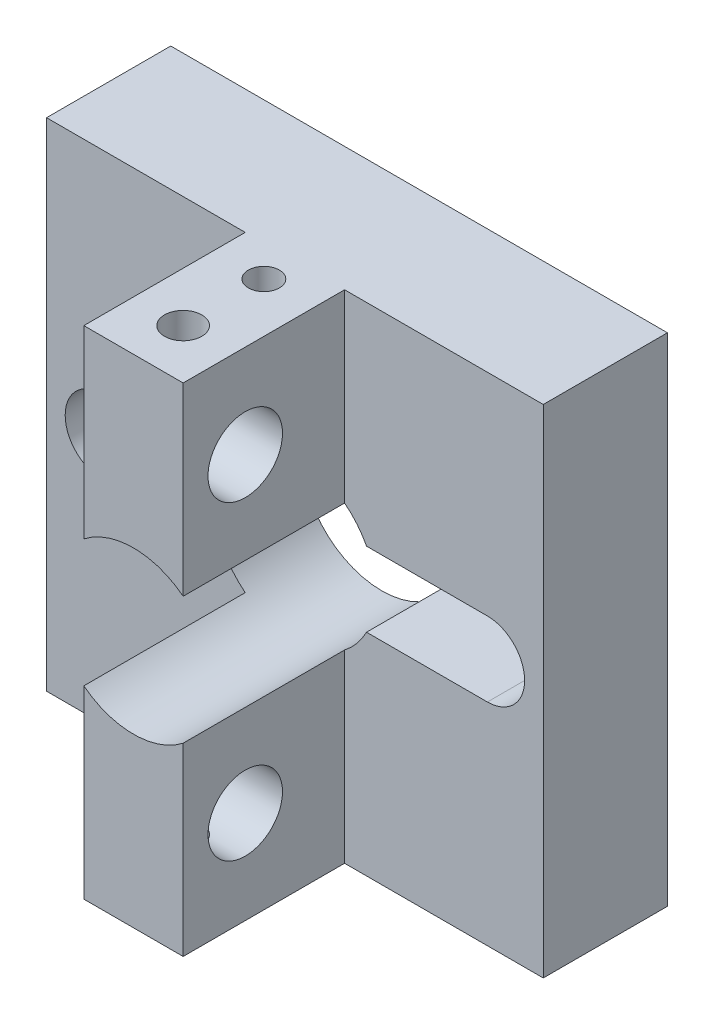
ISO-10303-21;
HEADER;
FILE_DESCRIPTION(('STEP AP214'),'2;1');
FILE_NAME('part.step','',(''),(''),'','','');
FILE_SCHEMA(('AUTOMOTIVE_DESIGN { 1 0 10303 214 1 1 1 1 }'));
ENDSEC;
DATA;
#1=APPLICATION_CONTEXT('core data for automotive mechanical design processes');
#2=APPLICATION_PROTOCOL_DEFINITION('international standard','automotive_design',2000,#1);
#3=PRODUCT_CONTEXT('',#1,'mechanical');
#4=PRODUCT('Part','Part','',(#3));
#5=PRODUCT_RELATED_PRODUCT_CATEGORY('part','',(#4));
#6=PRODUCT_DEFINITION_FORMATION('','',#4);
#7=PRODUCT_DEFINITION_CONTEXT('part definition',#1,'design');
#8=PRODUCT_DEFINITION('design','',#6,#7);
#9=PRODUCT_DEFINITION_SHAPE('','',#8);
#10=(LENGTH_UNIT() NAMED_UNIT(*) SI_UNIT(.MILLI.,.METRE.));
#11=(NAMED_UNIT(*) PLANE_ANGLE_UNIT() SI_UNIT($,.RADIAN.));
#12=(NAMED_UNIT(*) SI_UNIT($,.STERADIAN.) SOLID_ANGLE_UNIT());
#13=UNCERTAINTY_MEASURE_WITH_UNIT(LENGTH_MEASURE(1.E-05),#10,'distance_accuracy_value','');
#14=(GEOMETRIC_REPRESENTATION_CONTEXT(3) GLOBAL_UNCERTAINTY_ASSIGNED_CONTEXT((#13)) GLOBAL_UNIT_ASSIGNED_CONTEXT((#10,
#11,#12)) REPRESENTATION_CONTEXT('',''));
#15=CARTESIAN_POINT('',(0.,0.,0.));
#16=DIRECTION('',(0.,0.,1.));
#17=DIRECTION('',(1.,0.,0.));
#18=AXIS2_PLACEMENT_3D('',#15,#16,#17);
#19=CARTESIAN_POINT('',(0.,0.,10.));
#20=DIRECTION('',(0.,1.,0.));
#21=DIRECTION('',(0.,0.,1.));
#22=AXIS2_PLACEMENT_3D('',#19,#20,#21);
#23=PLANE('',#22);
#24=CARTESIAN_POINT('',(20.,0.,19.));
#25=DIRECTION('',(0.,-1.,0.));
#26=DIRECTION('',(0.,0.,-1.));
#27=AXIS2_PLACEMENT_3D('',#24,#25,#26);
#28=CIRCLE('',#27,1.50000000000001);
#29=CARTESIAN_POINT('',(20.,0.,17.5));
#30=VERTEX_POINT('',#29);
#31=EDGE_CURVE('E366',#30,#30,#28,.T.);
#32=ORIENTED_EDGE('',*,*,#31,.F.);
#33=EDGE_LOOP('',(#32));
#34=FACE_BOUND('',#33,.T.);
#35=DIRECTION('',(1.,0.,0.));
#36=VECTOR('',#35,1.);
#37=CARTESIAN_POINT('',(0.,0.,0.));
#38=LINE('',#37,#36);
#39=CARTESIAN_POINT('',(0.,0.,0.));
#40=VERTEX_POINT('',#39);
#41=CARTESIAN_POINT('',(40.,0.,0.));
#42=VERTEX_POINT('',#41);
#43=EDGE_CURVE('E250',#40,#42,#38,.T.);
#44=ORIENTED_EDGE('',*,*,#43,.T.);
#45=DIRECTION('',(0.,0.,-1.));
#46=VECTOR('',#45,1.);
#47=CARTESIAN_POINT('',(40.,0.,10.));
#48=LINE('',#47,#46);
#49=CARTESIAN_POINT('',(40.,0.,10.));
#50=VERTEX_POINT('',#49);
#51=EDGE_CURVE('E245',#50,#42,#48,.T.);
#52=ORIENTED_EDGE('',*,*,#51,.F.);
#53=DIRECTION('',(1.,0.,0.));
#54=VECTOR('',#53,1.);
#55=CARTESIAN_POINT('',(0.,0.,10.));
#56=LINE('',#55,#54);
#57=CARTESIAN_POINT('',(24.,0.,9.99999999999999));
#58=VERTEX_POINT('',#57);
#59=EDGE_CURVE('E274',#58,#50,#56,.T.);
#60=ORIENTED_EDGE('',*,*,#59,.F.);
#61=DIRECTION('',(0.,0.,-1.));
#62=VECTOR('',#61,1.);
#63=CARTESIAN_POINT('',(24.,0.,23.));
#64=LINE('',#63,#62);
#65=CARTESIAN_POINT('',(24.,0.,23.));
#66=VERTEX_POINT('',#65);
#67=EDGE_CURVE('E306',#66,#58,#64,.T.);
#68=ORIENTED_EDGE('',*,*,#67,.F.);
#69=DIRECTION('',(1.,0.,0.));
#70=VECTOR('',#69,1.);
#71=CARTESIAN_POINT('',(16.,0.,23.));
#72=LINE('',#71,#70);
#73=CARTESIAN_POINT('',(16.,0.,23.));
#74=VERTEX_POINT('',#73);
#75=EDGE_CURVE('E302',#74,#66,#72,.T.);
#76=ORIENTED_EDGE('',*,*,#75,.F.);
#77=DIRECTION('',(0.,0.,-1.));
#78=VECTOR('',#77,1.);
#79=CARTESIAN_POINT('',(16.,0.,23.));
#80=LINE('',#79,#78);
#81=CARTESIAN_POINT('',(16.,0.,9.99999999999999));
#82=VERTEX_POINT('',#81);
#83=EDGE_CURVE('E299',#74,#82,#80,.T.);
#84=ORIENTED_EDGE('',*,*,#83,.T.);
#85=CARTESIAN_POINT('',(0.,0.,10.));
#86=VERTEX_POINT('',#85);
#87=EDGE_CURVE('E276',#86,#82,#56,.T.);
#88=ORIENTED_EDGE('',*,*,#87,.F.);
#89=DIRECTION('',(0.,0.,-1.));
#90=VECTOR('',#89,1.);
#91=CARTESIAN_POINT('',(0.,0.,10.));
#92=LINE('',#91,#90);
#93=EDGE_CURVE('E280',#86,#40,#92,.T.);
#94=ORIENTED_EDGE('',*,*,#93,.T.);
#95=EDGE_LOOP('',(#44,#52,#60,#68,#76,#84,#88,#94));
#96=FACE_BOUND('',#95,.T.);
#97=CARTESIAN_POINT('',(20.,0.,12.5));
#98=DIRECTION('',(0.,-1.,0.));
#99=DIRECTION('',(0.,0.,-1.));
#100=AXIS2_PLACEMENT_3D('',#97,#98,#99);
#101=CIRCLE('',#100,1.25);
#102=CARTESIAN_POINT('',(20.,0.,11.25));
#103=VERTEX_POINT('',#102);
#104=EDGE_CURVE('E817',#103,#103,#101,.T.);
#105=ORIENTED_EDGE('',*,*,#104,.F.);
#106=EDGE_LOOP('',(#105));
#107=FACE_BOUND('',#106,.T.);
#108=ADVANCED_FACE('F37',(#34,#96,#107),#23,.F.);
#109=CARTESIAN_POINT('',(40.,40.,10.));
#110=DIRECTION('',(0.,-1.,0.));
#111=DIRECTION('',(0.,0.,-1.));
#112=AXIS2_PLACEMENT_3D('',#109,#110,#111);
#113=PLANE('',#112);
#114=CARTESIAN_POINT('',(20.,40.,19.));
#115=DIRECTION('',(0.,1.,0.));
#116=DIRECTION('',(0.,0.,1.));
#117=AXIS2_PLACEMENT_3D('',#114,#115,#116);
#118=CIRCLE('',#117,1.50000000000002);
#119=CARTESIAN_POINT('',(20.,40.,20.5));
#120=VERTEX_POINT('',#119);
#121=EDGE_CURVE('E336',#120,#120,#118,.T.);
#122=ORIENTED_EDGE('',*,*,#121,.F.);
#123=EDGE_LOOP('',(#122));
#124=FACE_BOUND('',#123,.T.);
#125=DIRECTION('',(-1.,0.,0.));
#126=VECTOR('',#125,1.);
#127=CARTESIAN_POINT('',(40.,40.,0.));
#128=LINE('',#127,#126);
#129=CARTESIAN_POINT('',(40.,40.,0.));
#130=VERTEX_POINT('',#129);
#131=CARTESIAN_POINT('',(0.,40.,0.));
#132=VERTEX_POINT('',#131);
#133=EDGE_CURVE('E251',#130,#132,#128,.T.);
#134=ORIENTED_EDGE('',*,*,#133,.T.);
#135=DIRECTION('',(0.,0.,-1.));
#136=VECTOR('',#135,1.);
#137=CARTESIAN_POINT('',(0.,40.,10.));
#138=LINE('',#137,#136);
#139=CARTESIAN_POINT('',(0.,40.,10.));
#140=VERTEX_POINT('',#139);
#141=EDGE_CURVE('E285',#140,#132,#138,.T.);
#142=ORIENTED_EDGE('',*,*,#141,.F.);
#143=DIRECTION('',(-1.,0.,0.));
#144=VECTOR('',#143,1.);
#145=CARTESIAN_POINT('',(40.,40.,10.));
#146=LINE('',#145,#144);
#147=CARTESIAN_POINT('',(16.,40.,10.));
#148=VERTEX_POINT('',#147);
#149=EDGE_CURVE('E262',#148,#140,#146,.T.);
#150=ORIENTED_EDGE('',*,*,#149,.F.);
#151=DIRECTION('',(0.,0.,-1.));
#152=VECTOR('',#151,1.);
#153=CARTESIAN_POINT('',(16.,40.,23.));
#154=LINE('',#153,#152);
#155=CARTESIAN_POINT('',(16.,40.,23.));
#156=VERTEX_POINT('',#155);
#157=EDGE_CURVE('E534',#156,#148,#154,.T.);
#158=ORIENTED_EDGE('',*,*,#157,.F.);
#159=DIRECTION('',(-1.,0.,0.));
#160=VECTOR('',#159,1.);
#161=CARTESIAN_POINT('',(24.,40.,23.));
#162=LINE('',#161,#160);
#163=CARTESIAN_POINT('',(24.,40.,23.));
#164=VERTEX_POINT('',#163);
#165=EDGE_CURVE('E530',#164,#156,#162,.T.);
#166=ORIENTED_EDGE('',*,*,#165,.F.);
#167=DIRECTION('',(0.,0.,-1.));
#168=VECTOR('',#167,1.);
#169=CARTESIAN_POINT('',(24.,40.,23.));
#170=LINE('',#169,#168);
#171=CARTESIAN_POINT('',(24.,40.,10.));
#172=VERTEX_POINT('',#171);
#173=EDGE_CURVE('E520',#164,#172,#170,.T.);
#174=ORIENTED_EDGE('',*,*,#173,.T.);
#175=CARTESIAN_POINT('',(40.,40.,10.));
#176=VERTEX_POINT('',#175);
#177=EDGE_CURVE('E271',#176,#172,#146,.T.);
#178=ORIENTED_EDGE('',*,*,#177,.F.);
#179=DIRECTION('',(0.,0.,-1.));
#180=VECTOR('',#179,1.);
#181=CARTESIAN_POINT('',(40.,40.,10.));
#182=LINE('',#181,#180);
#183=EDGE_CURVE('E242',#176,#130,#182,.T.);
#184=ORIENTED_EDGE('',*,*,#183,.T.);
#185=EDGE_LOOP('',(#134,#142,#150,#158,#166,#174,#178,#184));
#186=FACE_BOUND('',#185,.T.);
#187=CARTESIAN_POINT('',(20.,40.,12.5));
#188=DIRECTION('',(0.,1.,0.));
#189=DIRECTION('',(0.,0.,1.));
#190=AXIS2_PLACEMENT_3D('',#187,#188,#189);
#191=CIRCLE('',#190,1.25);
#192=CARTESIAN_POINT('',(20.,40.,13.75));
#193=VERTEX_POINT('',#192);
#194=EDGE_CURVE('E374',#193,#193,#191,.T.);
#195=ORIENTED_EDGE('',*,*,#194,.F.);
#196=EDGE_LOOP('',(#195));
#197=FACE_BOUND('',#196,.T.);
#198=ADVANCED_FACE('F212',(#124,#186,#197),#113,.F.);
#199=CARTESIAN_POINT('',(-2.50000000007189E-05,7.5,18.));
#200=DIRECTION('',(1.,0.,0.));
#201=DIRECTION('',(0.,0.,-1.));
#202=AXIS2_PLACEMENT_3D('',#199,#200,#201);
#203=CYLINDRICAL_SURFACE('',#202,3.);
#204=CARTESIAN_POINT('',(24.,7.5,18.));
#205=DIRECTION('',(1.,0.,0.));
#206=DIRECTION('',(0.,0.,-1.));
#207=AXIS2_PLACEMENT_3D('',#204,#205,#206);
#208=CIRCLE('',#207,3.);
#209=CARTESIAN_POINT('',(24.,7.5,15.));
#210=VERTEX_POINT('',#209);
#211=EDGE_CURVE('E335',#210,#210,#208,.T.);
#212=ORIENTED_EDGE('',*,*,#211,.T.);
#213=EDGE_LOOP('',(#212));
#214=FACE_BOUND('',#213,.T.);
#215=CARTESIAN_POINT('',(16.,7.5,18.));
#216=DIRECTION('',(-1.,0.,0.));
#217=DIRECTION('',(0.,0.,1.));
#218=AXIS2_PLACEMENT_3D('',#215,#216,#217);
#219=CIRCLE('',#218,3.);
#220=CARTESIAN_POINT('',(16.,7.5,21.));
#221=VERTEX_POINT('',#220);
#222=EDGE_CURVE('E362',#221,#221,#219,.T.);
#223=ORIENTED_EDGE('',*,*,#222,.T.);
#224=EDGE_LOOP('',(#223));
#225=FACE_BOUND('',#224,.T.);
#226=CARTESIAN_POINT('',(20.,4.54196010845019,17.5));
#227=CARTESIAN_POINT('',(19.9161367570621,4.5419561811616,17.5000040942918));
#228=CARTESIAN_POINT('',(19.8321706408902,4.54073940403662,17.507062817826));
#229=CARTESIAN_POINT('',(19.6665464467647,4.53620601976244,17.5351144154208));
#230=CARTESIAN_POINT('',(19.5848933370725,4.53288520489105,17.5561352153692));
#231=CARTESIAN_POINT('',(19.4263961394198,4.52513520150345,17.6114715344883));
#232=CARTESIAN_POINT('',(19.3495457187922,4.52070751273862,17.6457690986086));
#233=CARTESIAN_POINT('',(19.2026537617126,4.51219807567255,17.7267085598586));
#234=CARTESIAN_POINT('',(19.132610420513,4.50811623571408,17.7733471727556));
#235=CARTESIAN_POINT('',(19.0007747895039,4.5020170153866,17.8780895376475));
#236=CARTESIAN_POINT('',(18.9390425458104,4.50001402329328,17.9362699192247));
#237=CARTESIAN_POINT('',(18.8262553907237,4.49998616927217,18.0622039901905));
#238=CARTESIAN_POINT('',(18.775197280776,4.50196011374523,18.129954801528));
#239=CARTESIAN_POINT('',(18.6869436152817,4.51140252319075,18.2702701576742));
#240=CARTESIAN_POINT('',(18.6493201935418,4.51867339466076,18.3425783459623));
#241=CARTESIAN_POINT('',(18.5865019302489,4.5395864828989,18.4915225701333));
#242=CARTESIAN_POINT('',(18.5613018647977,4.55322601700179,18.5681567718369));
#243=CARTESIAN_POINT('',(18.5245914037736,4.58648601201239,18.7191039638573));
#244=CARTESIAN_POINT('',(18.5124583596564,4.60577256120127,18.7933408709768));
#245=CARTESIAN_POINT('',(18.4993294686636,4.65034824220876,18.9409750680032));
#246=CARTESIAN_POINT('',(18.498335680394,4.67563848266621,19.0143722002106));
#247=CARTESIAN_POINT('',(18.5067850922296,4.73254659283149,19.1608548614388));
#248=CARTESIAN_POINT('',(18.5165793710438,4.76434819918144,19.233847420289));
#249=CARTESIAN_POINT('',(18.5459471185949,4.83273211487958,19.3754549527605));
#250=CARTESIAN_POINT('',(18.56552354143,4.86931586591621,19.4440685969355));
#251=CARTESIAN_POINT('',(18.6166757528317,4.95172987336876,19.5855441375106));
#252=CARTESIAN_POINT('',(18.6495754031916,4.99813263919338,19.6575903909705));
#253=CARTESIAN_POINT('',(18.7250607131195,5.09414976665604,19.7941204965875));
#254=CARTESIAN_POINT('',(18.7676580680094,5.14376795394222,19.8585950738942));
#255=CARTESIAN_POINT('',(18.8709881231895,5.25469929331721,19.9918786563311));
#256=CARTESIAN_POINT('',(18.9336465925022,5.31634487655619,20.0589185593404));
#257=CARTESIAN_POINT('',(19.0707617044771,5.43837845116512,20.1810845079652));
#258=CARTESIAN_POINT('',(19.1452131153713,5.49876698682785,20.2362158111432));
#259=CARTESIAN_POINT('',(19.2778401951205,5.59265229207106,20.3161120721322));
#260=CARTESIAN_POINT('',(19.3323655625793,5.62806527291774,20.3446981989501));
#261=CARTESIAN_POINT('',(19.4470364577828,5.69389106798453,20.3957653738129));
#262=CARTESIAN_POINT('',(19.5071722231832,5.72431232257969,20.4182567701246));
#263=CARTESIAN_POINT('',(19.6177338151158,5.77036685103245,20.4513205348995));
#264=CARTESIAN_POINT('',(19.6669239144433,5.78779711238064,20.463463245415));
#265=CARTESIAN_POINT('',(19.7680840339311,5.8160362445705,20.482853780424));
#266=CARTESIAN_POINT('',(19.8200487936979,5.82685719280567,20.4901105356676));
#267=CARTESIAN_POINT('',(19.9260380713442,5.84034662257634,20.4991248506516));
#268=CARTESIAN_POINT('',(19.9800769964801,5.84294027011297,20.5008319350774));
#269=CARTESIAN_POINT('',(20.0877244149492,5.83928003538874,20.4984017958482));
#270=CARTESIAN_POINT('',(20.141332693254,5.83302197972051,20.4942618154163));
#271=CARTESIAN_POINT('',(20.2511709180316,5.81180807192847,20.4799551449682));
#272=CARTESIAN_POINT('',(20.3071795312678,5.79609592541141,20.4692627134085));
#273=CARTESIAN_POINT('',(20.4154276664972,5.75782374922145,20.4424101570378));
#274=CARTESIAN_POINT('',(20.467657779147,5.7352473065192,20.4262369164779));
#275=CARTESIAN_POINT('',(20.5963654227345,5.67156743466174,20.378895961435));
#276=CARTESIAN_POINT('',(20.6699702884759,5.62718309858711,20.3444098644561));
#277=CARTESIAN_POINT('',(20.8082833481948,5.53313057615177,20.2661008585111));
#278=CARTESIAN_POINT('',(20.8729678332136,5.48344890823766,20.2222538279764));
#279=CARTESIAN_POINT('',(21.0122625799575,5.36698103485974,20.1115093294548));
#280=CARTESIAN_POINT('',(21.0839956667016,5.29954949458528,20.0416467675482));
#281=CARTESIAN_POINT('',(21.2128927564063,5.16654332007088,19.8881987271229));
#282=CARTESIAN_POINT('',(21.2700720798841,5.1009667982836,19.804627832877));
#283=CARTESIAN_POINT('',(21.3582410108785,4.98761057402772,19.6418739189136));
#284=CARTESIAN_POINT('',(21.3921573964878,4.93884250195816,19.5649708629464));
#285=CARTESIAN_POINT('',(21.4471929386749,4.846974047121,19.4035794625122));
#286=CARTESIAN_POINT('',(21.4683299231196,4.80386583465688,19.3191018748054));
#287=CARTESIAN_POINT('',(21.4936040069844,4.73108312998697,19.1574724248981));
#288=CARTESIAN_POINT('',(21.4998134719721,4.7003636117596,19.0811190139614));
#289=CARTESIAN_POINT('',(21.5001778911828,4.64533270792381,18.9260805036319));
#290=CARTESIAN_POINT('',(21.4943381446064,4.62101851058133,18.8473964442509));
#291=CARTESIAN_POINT('',(21.46976090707,4.57925789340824,18.6898759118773));
#292=CARTESIAN_POINT('',(21.4509766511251,4.56183673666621,18.6110399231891));
#293=CARTESIAN_POINT('',(21.4003887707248,4.53387450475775,18.4563748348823));
#294=CARTESIAN_POINT('',(21.3685855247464,4.52333322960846,18.380545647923));
#295=CARTESIAN_POINT('',(21.2950982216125,4.50876881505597,18.2393040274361));
#296=CARTESIAN_POINT('',(21.2541648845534,4.50437612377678,18.1735361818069));
#297=CARTESIAN_POINT('',(21.1625813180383,4.49975257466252,18.0490112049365));
#298=CARTESIAN_POINT('',(21.1119306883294,4.49952188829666,17.9902543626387));
#299=CARTESIAN_POINT('',(21.0005421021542,4.50188921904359,17.8796131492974));
#300=CARTESIAN_POINT('',(20.9395428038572,4.50457404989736,17.8279942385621));
#301=CARTESIAN_POINT('',(20.8101507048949,4.51135525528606,17.7350870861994));
#302=CARTESIAN_POINT('',(20.7417529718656,4.51545257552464,17.6938057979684));
#303=CARTESIAN_POINT('',(20.5955485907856,4.52382915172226,17.6207441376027));
#304=CARTESIAN_POINT('',(20.5174369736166,4.52810671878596,17.589573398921));
#305=CARTESIAN_POINT('',(20.3571477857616,4.53525744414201,17.5407399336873));
#306=CARTESIAN_POINT('',(20.2749784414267,4.53813332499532,17.5230509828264));
#307=CARTESIAN_POINT('',(20.1601586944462,4.54057921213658,17.508228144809));
#308=CARTESIAN_POINT('',(20.1282112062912,4.54109424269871,17.5051451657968));
#309=CARTESIAN_POINT('',(20.0641808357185,4.5417854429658,17.5010303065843));
#310=CARTESIAN_POINT('',(20.032097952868,4.54196161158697,17.4999984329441));
#311=CARTESIAN_POINT('',(20.,4.54196010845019,17.5));
#312=B_SPLINE_CURVE_WITH_KNOTS('',3,(#226,#227,#228,#229,#230,#231,#232,#233,#234,#235,#236,
#237,#238,#239,#240,#241,#242,#243,#244,#245,#246,#247,#248,#249,#250,#251,#252,#253,#254,#255,
#256,#257,#258,#259,#260,#261,#262,#263,#264,#265,#266,#267,#268,#269,#270,#271,#272,#273,#274,
#275,#276,#277,#278,#279,#280,#281,#282,#283,#284,#285,#286,#287,#288,#289,#290,#291,#292,#293,
#294,#295,#296,#297,#298,#299,#300,#301,#302,#303,#304,#305,#306,#307,#308,#309,#310,#311),
.UNSPECIFIED.,.T.,.F.,(4,2,2,2,2,2,2,2,2,2,2,2,2,2,2,2,2,2,2,2,2,2,2,2,2,2,2,2,2,2,2,2,2,2,2,2,
2,2,2,2,2,2,4),(0.,0.25146735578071,0.503439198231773,0.755071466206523,1.00663683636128,
1.25993197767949,1.51315110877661,1.75737869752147,2.00150350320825,2.23339659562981,
2.46533254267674,2.70504550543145,2.94483090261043,3.21921669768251,3.49393516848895,
3.82432149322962,4.15456165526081,4.36715732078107,4.579389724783,4.73957138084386,
4.89945944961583,5.06079772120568,5.22221208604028,5.39867067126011,5.5755545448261,
5.8518633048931,6.12889285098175,6.48934985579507,6.84942582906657,7.13982793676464,
7.42982397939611,7.67637596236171,7.92281953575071,8.17015814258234,8.41748955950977,
8.64920345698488,8.88092690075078,9.11974429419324,9.35872189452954,9.61019489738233,
9.86117748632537,9.9574241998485,10.0536712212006),.UNSPECIFIED.);
#313=CARTESIAN_POINT('',(20.,4.54196010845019,17.5));
#314=VERTEX_POINT('',#313);
#315=EDGE_CURVE('E41',#314,#314,#312,.T.);
#316=ORIENTED_EDGE('',*,*,#315,.F.);
#317=EDGE_LOOP('',(#316));
#318=FACE_BOUND('',#317,.T.);
#319=ADVANCED_FACE('F218',(#214,#225,#318),#203,.F.);
#320=CARTESIAN_POINT('',(-2.50000000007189E-05,32.5,18.));
#321=DIRECTION('',(1.,0.,0.));
#322=DIRECTION('',(0.,0.,-1.));
#323=AXIS2_PLACEMENT_3D('',#320,#321,#322);
#324=CYLINDRICAL_SURFACE('',#323,3.);
#325=CARTESIAN_POINT('',(24.,32.5,18.));
#326=DIRECTION('',(1.,0.,0.));
#327=DIRECTION('',(0.,0.,-1.));
#328=AXIS2_PLACEMENT_3D('',#325,#326,#327);
#329=CIRCLE('',#328,3.);
#330=CARTESIAN_POINT('',(24.,32.5,15.));
#331=VERTEX_POINT('',#330);
#332=EDGE_CURVE('E380',#331,#331,#329,.T.);
#333=ORIENTED_EDGE('',*,*,#332,.T.);
#334=EDGE_LOOP('',(#333));
#335=FACE_BOUND('',#334,.T.);
#336=CARTESIAN_POINT('',(16.,32.5,18.));
#337=DIRECTION('',(-1.,0.,0.));
#338=DIRECTION('',(0.,0.,1.));
#339=AXIS2_PLACEMENT_3D('',#336,#337,#338);
#340=CIRCLE('',#339,3.);
#341=CARTESIAN_POINT('',(16.,32.5,21.));
#342=VERTEX_POINT('',#341);
#343=EDGE_CURVE('E383',#342,#342,#340,.T.);
#344=ORIENTED_EDGE('',*,*,#343,.T.);
#345=EDGE_LOOP('',(#344));
#346=FACE_BOUND('',#345,.T.);
#347=CARTESIAN_POINT('',(20.,34.1583123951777,20.5));
#348=CARTESIAN_POINT('',(19.948548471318,34.1583206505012,20.4999961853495));
#349=CARTESIAN_POINT('',(19.8970200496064,34.1623716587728,20.4973216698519));
#350=CARTESIAN_POINT('',(19.7955955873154,34.1779339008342,20.4868892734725));
#351=CARTESIAN_POINT('',(19.7457044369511,34.1894656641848,20.4791174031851));
#352=CARTESIAN_POINT('',(19.6330347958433,34.2231131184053,20.4558935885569));
#353=CARTESIAN_POINT('',(19.5712747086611,34.2474403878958,20.4387751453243));
#354=CARTESIAN_POINT('',(19.4531015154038,34.3027893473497,20.3981524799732));
#355=CARTESIAN_POINT('',(19.3967032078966,34.3338288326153,20.3746312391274));
#356=CARTESIAN_POINT('',(19.2578319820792,34.4189379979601,20.3069613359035));
#357=CARTESIAN_POINT('',(19.1791519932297,34.4759420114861,20.2587518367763));
#358=CARTESIAN_POINT('',(19.0332784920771,34.5932488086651,20.1505209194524));
#359=CARTESIAN_POINT('',(18.9661021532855,34.6535563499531,20.090482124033));
#360=CARTESIAN_POINT('',(18.8407723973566,34.7760932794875,19.9565188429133));
#361=CARTESIAN_POINT('',(18.7830871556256,34.8383030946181,19.882135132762));
#362=CARTESIAN_POINT('',(18.6816316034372,34.9588036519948,19.7217193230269));
#363=CARTESIAN_POINT('',(18.6378376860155,35.0171009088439,19.6357073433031));
#364=CARTESIAN_POINT('',(18.5736954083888,35.1160009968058,19.471010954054));
#365=CARTESIAN_POINT('',(18.5504316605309,35.1578303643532,19.3942048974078));
#366=CARTESIAN_POINT('',(18.5162814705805,35.2354596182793,19.234943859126));
#367=CARTESIAN_POINT('',(18.5053886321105,35.2712626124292,19.1524918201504));
#368=CARTESIAN_POINT('',(18.4976917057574,35.3356856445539,18.9834228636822));
#369=CARTESIAN_POINT('',(18.5009906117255,35.3642515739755,18.8967800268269));
#370=CARTESIAN_POINT('',(18.5231871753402,35.4129406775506,18.7231118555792));
#371=CARTESIAN_POINT('',(18.5420741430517,35.4330696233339,18.6360868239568));
#372=CARTESIAN_POINT('',(18.5923588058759,35.4630038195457,18.4758587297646));
#373=CARTESIAN_POINT('',(18.621954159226,35.4737673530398,18.4022624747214));
#374=CARTESIAN_POINT('',(18.692714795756,35.4895487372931,18.2602035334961));
#375=CARTESIAN_POINT('',(18.7338793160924,35.4945669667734,18.191740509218));
#376=CARTESIAN_POINT('',(18.8254474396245,35.4999887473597,18.063805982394));
#377=CARTESIAN_POINT('',(18.875585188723,35.5005080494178,18.0041480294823));
#378=CARTESIAN_POINT('',(18.9844577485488,35.4986160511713,17.8933335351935));
#379=CARTESIAN_POINT('',(19.0431943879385,35.4962041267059,17.8421788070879));
#380=CARTESIAN_POINT('',(19.1711560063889,35.4897237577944,17.7471215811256));
#381=CARTESIAN_POINT('',(19.2407738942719,35.4855736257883,17.7037531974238));
#382=CARTESIAN_POINT('',(19.3861401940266,35.4772004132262,17.6289194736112));
#383=CARTESIAN_POINT('',(19.4618896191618,35.4729773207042,17.5974561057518));
#384=CARTESIAN_POINT('',(19.6200723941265,35.4656354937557,17.5464603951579));
#385=CARTESIAN_POINT('',(19.7026423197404,35.4625566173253,17.5273440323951));
#386=CARTESIAN_POINT('',(19.8698678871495,35.4586164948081,17.5032700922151));
#387=CARTESIAN_POINT('',(19.9545233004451,35.4577550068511,17.4983109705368));
#388=CARTESIAN_POINT('',(20.1224904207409,35.4584917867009,17.5026775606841));
#389=CARTESIAN_POINT('',(20.2058064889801,35.4600623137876,17.5118421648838));
#390=CARTESIAN_POINT('',(20.3697006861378,35.4651662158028,17.543876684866));
#391=CARTESIAN_POINT('',(20.4502785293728,35.4686997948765,17.5667480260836));
#392=CARTESIAN_POINT('',(20.6065842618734,35.4766900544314,17.625576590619));
#393=CARTESIAN_POINT('',(20.6823050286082,35.4811480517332,17.6615525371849));
#394=CARTESIAN_POINT('',(20.826746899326,35.4894929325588,17.7456184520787));
#395=CARTESIAN_POINT('',(20.8954670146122,35.4933797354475,17.7937101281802));
#396=CARTESIAN_POINT('',(21.0246380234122,35.4988612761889,17.9012525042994));
#397=CARTESIAN_POINT('',(21.0850016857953,35.5004332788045,17.9608094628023));
#398=CARTESIAN_POINT('',(21.1948226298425,35.4993581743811,18.0892158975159));
#399=CARTESIAN_POINT('',(21.2442842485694,35.4967127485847,18.1580616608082));
#400=CARTESIAN_POINT('',(21.3290816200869,35.4857829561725,18.2999270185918));
#401=CARTESIAN_POINT('',(21.3648931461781,35.4777225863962,18.3726790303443));
#402=CARTESIAN_POINT('',(21.4241058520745,35.4551811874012,18.5221130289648));
#403=CARTESIAN_POINT('',(21.4475117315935,35.4407025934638,18.5987935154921));
#404=CARTESIAN_POINT('',(21.4808890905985,35.4058026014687,18.7496836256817));
#405=CARTESIAN_POINT('',(21.4914437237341,35.3856947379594,18.8238385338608));
#406=CARTESIAN_POINT('',(21.5015347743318,35.3395523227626,18.9710280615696));
#407=CARTESIAN_POINT('',(21.5010687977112,35.313516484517,19.0440624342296));
#408=CARTESIAN_POINT('',(21.4897754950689,35.2549901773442,19.1901586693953));
#409=CARTESIAN_POINT('',(21.4785204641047,35.2222773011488,19.2630967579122));
#410=CARTESIAN_POINT('',(21.4462828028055,35.1521589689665,19.4043804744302));
#411=CARTESIAN_POINT('',(21.4252973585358,35.1147521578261,19.4727247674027));
#412=CARTESIAN_POINT('',(21.3710292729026,35.0304509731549,19.613861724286));
#413=CARTESIAN_POINT('',(21.3363710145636,34.9829760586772,19.6857752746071));
#414=CARTESIAN_POINT('',(21.2573115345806,34.8849651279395,19.8218091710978));
#415=CARTESIAN_POINT('',(21.2128970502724,34.8344250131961,19.8859187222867));
#416=CARTESIAN_POINT('',(21.1054422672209,34.7217075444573,20.0181700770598));
#417=CARTESIAN_POINT('',(21.0404512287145,34.6592501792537,20.0844894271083));
#418=CARTESIAN_POINT('',(20.8983779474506,34.5362018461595,20.2048208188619));
#419=CARTESIAN_POINT('',(20.82130603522,34.4756093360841,20.258843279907));
#420=CARTESIAN_POINT('',(20.6871172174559,34.3845480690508,20.3346304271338));
#421=CARTESIAN_POINT('',(20.6341040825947,34.3516174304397,20.3607180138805));
#422=CARTESIAN_POINT('',(20.5229030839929,34.2907745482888,20.4071935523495));
#423=CARTESIAN_POINT('',(20.4647230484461,34.2628549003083,20.4275899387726));
#424=CARTESIAN_POINT('',(20.3566800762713,34.2203869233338,20.4578030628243));
#425=CARTESIAN_POINT('',(20.3078305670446,34.2042465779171,20.4689626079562));
#426=CARTESIAN_POINT('',(20.2076168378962,34.1786717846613,20.4864246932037));
#427=CARTESIAN_POINT('',(20.1562612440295,34.1692158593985,20.4927427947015));
#428=CARTESIAN_POINT('',(20.08705211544,34.1619659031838,20.4975732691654));
#429=CARTESIAN_POINT('',(20.0696862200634,34.1605998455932,20.4984814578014));
#430=CARTESIAN_POINT('',(20.034883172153,34.1587716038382,20.4996955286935));
#431=CARTESIAN_POINT('',(20.0174460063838,34.1583095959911,20.5000012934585));
#432=CARTESIAN_POINT('',(20.,34.1583123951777,20.5));
#433=B_SPLINE_CURVE_WITH_KNOTS('',3,(#347,#348,#349,#350,#351,#352,#353,#354,#355,#356,#357,
#358,#359,#360,#361,#362,#363,#364,#365,#366,#367,#368,#369,#370,#371,#372,#373,#374,#375,#376,
#377,#378,#379,#380,#381,#382,#383,#384,#385,#386,#387,#388,#389,#390,#391,#392,#393,#394,#395,
#396,#397,#398,#399,#400,#401,#402,#403,#404,#405,#406,#407,#408,#409,#410,#411,#412,#413,#414,
#415,#416,#417,#418,#419,#420,#421,#422,#423,#424,#425,#426,#427,#428,#429,#430,#431,#432),
.UNSPECIFIED.,.T.,.F.,(4,2,2,2,2,2,2,2,2,2,2,2,2,2,2,2,2,2,2,2,2,2,2,2,2,2,2,2,2,2,2,2,2,2,2,2,
2,2,2,2,2,2,4),(0.,0.154278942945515,0.308983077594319,0.513463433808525,0.718492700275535,
1.04214556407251,1.3662774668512,1.70336961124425,2.03988579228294,2.31031336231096,
2.58060104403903,2.85285358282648,3.1249195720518,3.36387428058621,3.60281323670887,
3.83558578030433,4.0684078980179,4.31368055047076,4.55899381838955,4.81219173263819,
5.06536202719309,5.31566574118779,5.56599549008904,5.81668431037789,6.06740848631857,
6.32057914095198,6.57364889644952,6.81684657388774,7.0599520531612,7.29155707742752,
7.52321241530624,7.76444804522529,8.00575348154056,8.28338403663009,8.56139436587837,
8.89582954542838,9.22998028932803,9.43246164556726,9.63464129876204,9.79202401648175,
9.94889872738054,10.0012008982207,10.0535132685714),.UNSPECIFIED.);
#434=CARTESIAN_POINT('',(20.,34.1583123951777,20.5));
#435=VERTEX_POINT('',#434);
#436=EDGE_CURVE('E329',#435,#435,#433,.T.);
#437=ORIENTED_EDGE('',*,*,#436,.F.);
#438=EDGE_LOOP('',(#437));
#439=FACE_BOUND('',#438,.T.);
#440=ADVANCED_FACE('F337',(#335,#346,#439),#324,.F.);
#441=CARTESIAN_POINT('',(4.5,23.,3.));
#442=DIRECTION('',(0.,-1.,0.));
#443=DIRECTION('',(0.,0.,-1.));
#444=AXIS2_PLACEMENT_3D('',#441,#442,#443);
#445=PLANE('',#444);
#446=DIRECTION('',(0.,0.,1.));
#447=VECTOR('',#446,1.);
#448=CARTESIAN_POINT('',(25.7662812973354,23.,0.));
#449=LINE('',#448,#447);
#450=CARTESIAN_POINT('',(25.7662812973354,23.,3.));
#451=VERTEX_POINT('',#450);
#452=CARTESIAN_POINT('',(25.7662812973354,23.,10.));
#453=VERTEX_POINT('',#452);
#454=EDGE_CURVE('E390',#451,#453,#449,.T.);
#455=ORIENTED_EDGE('',*,*,#454,.F.);
#456=DIRECTION('',(1.,0.,0.));
#457=VECTOR('',#456,1.);
#458=CARTESIAN_POINT('',(4.5,23.,3.));
#459=LINE('',#458,#457);
#460=CARTESIAN_POINT('',(33.6747943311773,23.,3.));
#461=VERTEX_POINT('',#460);
#462=EDGE_CURVE('E436',#451,#461,#459,.T.);
#463=ORIENTED_EDGE('',*,*,#462,.T.);
#464=CARTESIAN_POINT('',(35.5,23.,3.));
#465=VERTEX_POINT('',#464);
#466=EDGE_CURVE('E430',#461,#465,#459,.T.);
#467=ORIENTED_EDGE('',*,*,#466,.T.);
#468=DIRECTION('',(0.,0.,1.));
#469=VECTOR('',#468,1.);
#470=CARTESIAN_POINT('',(35.5,23.,3.));
#471=LINE('',#470,#469);
#472=CARTESIAN_POINT('',(35.5,23.,10.));
#473=VERTEX_POINT('',#472);
#474=EDGE_CURVE('E441',#465,#473,#471,.T.);
#475=ORIENTED_EDGE('',*,*,#474,.T.);
#476=DIRECTION('',(1.,0.,0.));
#477=VECTOR('',#476,1.);
#478=CARTESIAN_POINT('',(0.,23.,10.));
#479=LINE('',#478,#477);
#480=EDGE_CURVE('E452',#453,#473,#479,.T.);
#481=ORIENTED_EDGE('',*,*,#480,.F.);
#482=EDGE_LOOP('',(#455,#463,#467,#475,#481));
#483=FACE_BOUND('',#482,.T.);
#484=ADVANCED_FACE('F354',(#483),#445,.T.);
#485=CARTESIAN_POINT('',(4.5,17.,3.00000000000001));
#486=DIRECTION('',(0.,-1.,0.));
#487=DIRECTION('',(0.,0.,-1.));
#488=AXIS2_PLACEMENT_3D('',#485,#486,#487);
#489=PLANE('',#488);
#490=DIRECTION('',(1.,0.,0.));
#491=VECTOR('',#490,1.);
#492=CARTESIAN_POINT('',(4.5,17.,3.00000000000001));
#493=LINE('',#492,#491);
#494=CARTESIAN_POINT('',(25.7662812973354,17.,3.));
#495=VERTEX_POINT('',#494);
#496=CARTESIAN_POINT('',(33.6747943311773,17.,3.));
#497=VERTEX_POINT('',#496);
#498=EDGE_CURVE('E427',#495,#497,#493,.T.);
#499=ORIENTED_EDGE('',*,*,#498,.F.);
#500=DIRECTION('',(0.,0.,1.));
#501=VECTOR('',#500,1.);
#502=CARTESIAN_POINT('',(25.7662812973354,17.,0.));
#503=LINE('',#502,#501);
#504=CARTESIAN_POINT('',(25.7662812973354,17.,10.));
#505=VERTEX_POINT('',#504);
#506=EDGE_CURVE('E58',#495,#505,#503,.T.);
#507=ORIENTED_EDGE('',*,*,#506,.T.);
#508=DIRECTION('',(1.,0.,0.));
#509=VECTOR('',#508,1.);
#510=CARTESIAN_POINT('',(0.,17.,10.));
#511=LINE('',#510,#509);
#512=CARTESIAN_POINT('',(35.5,17.,10.));
#513=VERTEX_POINT('',#512);
#514=EDGE_CURVE('E440',#505,#513,#511,.T.);
#515=ORIENTED_EDGE('',*,*,#514,.T.);
#516=DIRECTION('',(0.,0.,1.));
#517=VECTOR('',#516,1.);
#518=CARTESIAN_POINT('',(35.5,17.,3.));
#519=LINE('',#518,#517);
#520=CARTESIAN_POINT('',(35.5,17.,3.));
#521=VERTEX_POINT('',#520);
#522=EDGE_CURVE('E444',#521,#513,#519,.T.);
#523=ORIENTED_EDGE('',*,*,#522,.F.);
#524=EDGE_CURVE('E421',#497,#521,#493,.T.);
#525=ORIENTED_EDGE('',*,*,#524,.F.);
#526=EDGE_LOOP('',(#499,#507,#515,#523,#525));
#527=FACE_BOUND('',#526,.T.);
#528=ADVANCED_FACE('F493',(#527),#489,.F.);
#529=CARTESIAN_POINT('',(4.5,20.,3.));
#530=DIRECTION('',(0.,0.,1.));
#531=DIRECTION('',(1.,0.,0.));
#532=AXIS2_PLACEMENT_3D('',#529,#530,#531);
#533=PLANE('',#532);
#534=CARTESIAN_POINT('',(20.,20.,3.));
#535=DIRECTION('',(0.,0.,1.));
#536=DIRECTION('',(1.,0.,0.));
#537=AXIS2_PLACEMENT_3D('',#534,#535,#536);
#538=CIRCLE('',#537,14.);
#539=CARTESIAN_POINT('',(6.32520566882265,23.,3.));
#540=VERTEX_POINT('',#539);
#541=CARTESIAN_POINT('',(6.32520566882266,17.,3.00000000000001));
#542=VERTEX_POINT('',#541);
#543=EDGE_CURVE('E50',#540,#542,#538,.T.);
#544=ORIENTED_EDGE('',*,*,#543,.F.);
#545=CARTESIAN_POINT('',(4.5,23.,3.));
#546=VERTEX_POINT('',#545);
#547=EDGE_CURVE('E431',#546,#540,#459,.T.);
#548=ORIENTED_EDGE('',*,*,#547,.F.);
#549=CARTESIAN_POINT('',(4.5,20.,3.));
#550=DIRECTION('',(0.,0.,1.));
#551=DIRECTION('',(1.,0.,0.));
#552=AXIS2_PLACEMENT_3D('',#549,#550,#551);
#553=CIRCLE('',#552,3.);
#554=CARTESIAN_POINT('',(4.5,17.,3.00000000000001));
#555=VERTEX_POINT('',#554);
#556=EDGE_CURVE('E418',#546,#555,#553,.T.);
#557=ORIENTED_EDGE('',*,*,#556,.T.);
#558=EDGE_CURVE('E422',#555,#542,#493,.T.);
#559=ORIENTED_EDGE('',*,*,#558,.T.);
#560=EDGE_LOOP('',(#544,#548,#557,#559));
#561=FACE_BOUND('',#560,.T.);
#562=ADVANCED_FACE('F473',(#561),#533,.T.);
#563=CARTESIAN_POINT('',(0.,40.,10.));
#564=DIRECTION('',(0.,0.,1.));
#565=DIRECTION('',(1.,0.,0.));
#566=AXIS2_PLACEMENT_3D('',#563,#564,#565);
#567=PLANE('',#566);
#568=CARTESIAN_POINT('',(20.,20.,10.));
#569=DIRECTION('',(0.,0.,1.));
#570=DIRECTION('',(1.,0.,0.));
#571=AXIS2_PLACEMENT_3D('',#568,#569,#570);
#572=CIRCLE('',#571,6.5);
#573=CARTESIAN_POINT('',(16.,25.1234753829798,9.99999999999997));
#574=VERTEX_POINT('',#573);
#575=CARTESIAN_POINT('',(14.2337187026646,23.,10.));
#576=VERTEX_POINT('',#575);
#577=EDGE_CURVE('E394',#574,#576,#572,.T.);
#578=ORIENTED_EDGE('',*,*,#577,.F.);
#579=DIRECTION('',(0.,1.,0.));
#580=VECTOR('',#579,1.);
#581=CARTESIAN_POINT('',(16.,0.,9.99999999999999));
#582=LINE('',#581,#580);
#583=EDGE_CURVE('E311',#574,#148,#582,.T.);
#584=ORIENTED_EDGE('',*,*,#583,.T.);
#585=ORIENTED_EDGE('',*,*,#149,.T.);
#586=DIRECTION('',(0.,1.,0.));
#587=VECTOR('',#586,1.);
#588=CARTESIAN_POINT('',(0.,0.,10.));
#589=LINE('',#588,#587);
#590=EDGE_CURVE('E253',#86,#140,#589,.T.);
#591=ORIENTED_EDGE('',*,*,#590,.F.);
#592=ORIENTED_EDGE('',*,*,#87,.T.);
#593=CARTESIAN_POINT('',(16.,14.8765246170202,9.99999999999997));
#594=VERTEX_POINT('',#593);
#595=EDGE_CURVE('E296',#82,#594,#582,.T.);
#596=ORIENTED_EDGE('',*,*,#595,.T.);
#597=CARTESIAN_POINT('',(14.2337187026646,17.,10.));
#598=VERTEX_POINT('',#597);
#599=EDGE_CURVE('E398',#598,#594,#572,.T.);
#600=ORIENTED_EDGE('',*,*,#599,.F.);
#601=DIRECTION('',(1.,0.,0.));
#602=VECTOR('',#601,1.);
#603=CARTESIAN_POINT('',(0.,17.,10.));
#604=LINE('',#603,#602);
#605=CARTESIAN_POINT('',(4.5,17.,10.));
#606=VERTEX_POINT('',#605);
#607=EDGE_CURVE('E450',#606,#598,#604,.T.);
#608=ORIENTED_EDGE('',*,*,#607,.F.);
#609=CARTESIAN_POINT('',(4.5,20.,10.));
#610=DIRECTION('',(0.,0.,1.));
#611=DIRECTION('',(1.,0.,0.));
#612=AXIS2_PLACEMENT_3D('',#609,#610,#611);
#613=CIRCLE('',#612,3.);
#614=CARTESIAN_POINT('',(4.49999999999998,23.,10.));
#615=VERTEX_POINT('',#614);
#616=EDGE_CURVE('E462',#615,#606,#613,.T.);
#617=ORIENTED_EDGE('',*,*,#616,.F.);
#618=DIRECTION('',(1.,0.,0.));
#619=VECTOR('',#618,1.);
#620=CARTESIAN_POINT('',(0.,23.,10.));
#621=LINE('',#620,#619);
#622=EDGE_CURVE('E315',#615,#576,#621,.T.);
#623=ORIENTED_EDGE('',*,*,#622,.T.);
#624=EDGE_LOOP('',(#578,#584,#585,#591,#592,#596,#600,#608,#617,#623));
#625=FACE_BOUND('',#624,.T.);
#626=ADVANCED_FACE('F224',(#625),#567,.T.);
#627=CARTESIAN_POINT('',(20.,20.,10.));
#628=DIRECTION('',(0.,0.,1.));
#629=DIRECTION('',(1.,0.,0.));
#630=AXIS2_PLACEMENT_3D('',#627,#628,#629);
#631=CIRCLE('',#630,6.5);
#632=CARTESIAN_POINT('',(24.,25.1234753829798,9.99999999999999));
#633=VERTEX_POINT('',#632);
#634=EDGE_CURVE('E392',#453,#633,#631,.T.);
#635=ORIENTED_EDGE('',*,*,#634,.F.);
#636=ORIENTED_EDGE('',*,*,#480,.T.);
#637=CARTESIAN_POINT('',(35.5,20.,10.));
#638=DIRECTION('',(0.,0.,1.));
#639=DIRECTION('',(1.,0.,0.));
#640=AXIS2_PLACEMENT_3D('',#637,#638,#639);
#641=CIRCLE('',#640,3.);
#642=EDGE_CURVE('E283',#513,#473,#641,.T.);
#643=ORIENTED_EDGE('',*,*,#642,.F.);
#644=ORIENTED_EDGE('',*,*,#514,.F.);
#645=CARTESIAN_POINT('',(24.,14.8765246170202,9.99999999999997));
#646=VERTEX_POINT('',#645);
#647=EDGE_CURVE('E395',#646,#505,#631,.T.);
#648=ORIENTED_EDGE('',*,*,#647,.F.);
#649=DIRECTION('',(0.,-1.,0.));
#650=VECTOR('',#649,1.);
#651=CARTESIAN_POINT('',(24.,40.,10.));
#652=LINE('',#651,#650);
#653=EDGE_CURVE('E310',#646,#58,#652,.T.);
#654=ORIENTED_EDGE('',*,*,#653,.T.);
#655=ORIENTED_EDGE('',*,*,#59,.T.);
#656=DIRECTION('',(0.,-1.,0.));
#657=VECTOR('',#656,1.);
#658=CARTESIAN_POINT('',(40.,40.,10.));
#659=LINE('',#658,#657);
#660=EDGE_CURVE('E265',#176,#50,#659,.T.);
#661=ORIENTED_EDGE('',*,*,#660,.F.);
#662=ORIENTED_EDGE('',*,*,#177,.T.);
#663=EDGE_CURVE('E313',#172,#633,#652,.T.);
#664=ORIENTED_EDGE('',*,*,#663,.T.);
#665=EDGE_LOOP('',(#635,#636,#643,#644,#648,#654,#655,#661,#662,#664));
#666=FACE_BOUND('',#665,.T.);
#667=ADVANCED_FACE('F495',(#666),#567,.T.);
#668=CARTESIAN_POINT('',(16.,0.,23.));
#669=DIRECTION('',(-1.,0.,0.));
#670=DIRECTION('',(0.,0.,1.));
#671=AXIS2_PLACEMENT_3D('',#668,#669,#670);
#672=PLANE('',#671);
#673=ORIENTED_EDGE('',*,*,#343,.F.);
#674=EDGE_LOOP('',(#673));
#675=FACE_BOUND('',#674,.T.);
#676=DIRECTION('',(0.,0.,1.));
#677=VECTOR('',#676,1.);
#678=CARTESIAN_POINT('',(16.,25.1234753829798,0.));
#679=LINE('',#678,#677);
#680=CARTESIAN_POINT('',(16.,25.1234753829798,23.));
#681=VERTEX_POINT('',#680);
#682=EDGE_CURVE('E400',#681,#574,#679,.F.);
#683=ORIENTED_EDGE('',*,*,#682,.F.);
#684=DIRECTION('',(0.,1.,0.));
#685=VECTOR('',#684,1.);
#686=CARTESIAN_POINT('',(16.,0.,23.));
#687=LINE('',#686,#685);
#688=EDGE_CURVE('E538',#681,#156,#687,.T.);
#689=ORIENTED_EDGE('',*,*,#688,.T.);
#690=ORIENTED_EDGE('',*,*,#157,.T.);
#691=ORIENTED_EDGE('',*,*,#583,.F.);
#692=EDGE_LOOP('',(#683,#689,#690,#691));
#693=FACE_BOUND('',#692,.T.);
#694=ADVANCED_FACE('F554',(#675,#693),#672,.T.);
#695=CARTESIAN_POINT('',(24.,40.,23.));
#696=DIRECTION('',(1.,0.,0.));
#697=DIRECTION('',(0.,0.,-1.));
#698=AXIS2_PLACEMENT_3D('',#695,#696,#697);
#699=PLANE('',#698);
#700=ORIENTED_EDGE('',*,*,#332,.F.);
#701=EDGE_LOOP('',(#700));
#702=FACE_BOUND('',#701,.T.);
#703=DIRECTION('',(0.,0.,1.));
#704=VECTOR('',#703,1.);
#705=CARTESIAN_POINT('',(24.,25.1234753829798,0.));
#706=LINE('',#705,#704);
#707=CARTESIAN_POINT('',(24.,25.1234753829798,23.));
#708=VERTEX_POINT('',#707);
#709=EDGE_CURVE('E397',#633,#708,#706,.T.);
#710=ORIENTED_EDGE('',*,*,#709,.F.);
#711=ORIENTED_EDGE('',*,*,#663,.F.);
#712=ORIENTED_EDGE('',*,*,#173,.F.);
#713=DIRECTION('',(0.,-1.,0.));
#714=VECTOR('',#713,1.);
#715=CARTESIAN_POINT('',(24.,40.,23.));
#716=LINE('',#715,#714);
#717=EDGE_CURVE('E547',#164,#708,#716,.T.);
#718=ORIENTED_EDGE('',*,*,#717,.T.);
#719=EDGE_LOOP('',(#710,#711,#712,#718));
#720=FACE_BOUND('',#719,.T.);
#721=ADVANCED_FACE('F537',(#702,#720),#699,.T.);
#722=CARTESIAN_POINT('',(16.,40.,23.));
#723=DIRECTION('',(0.,0.,1.));
#724=DIRECTION('',(1.,0.,0.));
#725=AXIS2_PLACEMENT_3D('',#722,#723,#724);
#726=PLANE('',#725);
#727=CARTESIAN_POINT('',(20.,20.,23.));
#728=DIRECTION('',(0.,0.,1.));
#729=DIRECTION('',(1.,0.,0.));
#730=AXIS2_PLACEMENT_3D('',#727,#728,#729);
#731=CIRCLE('',#730,6.5);
#732=EDGE_CURVE('E387',#708,#681,#731,.T.);
#733=ORIENTED_EDGE('',*,*,#732,.F.);
#734=ORIENTED_EDGE('',*,*,#717,.F.);
#735=ORIENTED_EDGE('',*,*,#165,.T.);
#736=ORIENTED_EDGE('',*,*,#688,.F.);
#737=EDGE_LOOP('',(#733,#734,#735,#736));
#738=FACE_BOUND('',#737,.T.);
#739=ADVANCED_FACE('F236',(#738),#726,.T.);
#740=CARTESIAN_POINT('',(0.,0.,10.));
#741=DIRECTION('',(-1.,0.,0.));
#742=DIRECTION('',(0.,-1.,0.));
#743=AXIS2_PLACEMENT_3D('',#740,#741,#742);
#744=PLANE('',#743);
#745=DIRECTION('',(0.,1.,0.));
#746=VECTOR('',#745,1.);
#747=CARTESIAN_POINT('',(0.,0.,0.));
#748=LINE('',#747,#746);
#749=EDGE_CURVE('E256',#40,#132,#748,.T.);
#750=ORIENTED_EDGE('',*,*,#749,.F.);
#751=ORIENTED_EDGE('',*,*,#93,.F.);
#752=ORIENTED_EDGE('',*,*,#590,.T.);
#753=ORIENTED_EDGE('',*,*,#141,.T.);
#754=EDGE_LOOP('',(#750,#751,#752,#753));
#755=FACE_BOUND('',#754,.T.);
#756=ADVANCED_FACE('F39',(#755),#744,.T.);
#757=CARTESIAN_POINT('',(40.,40.,10.));
#758=DIRECTION('',(1.,0.,0.));
#759=DIRECTION('',(0.,0.,-1.));
#760=AXIS2_PLACEMENT_3D('',#757,#758,#759);
#761=PLANE('',#760);
#762=DIRECTION('',(0.,-1.,0.));
#763=VECTOR('',#762,1.);
#764=CARTESIAN_POINT('',(40.,40.,0.));
#765=LINE('',#764,#763);
#766=EDGE_CURVE('E240',#130,#42,#765,.T.);
#767=ORIENTED_EDGE('',*,*,#766,.F.);
#768=ORIENTED_EDGE('',*,*,#183,.F.);
#769=ORIENTED_EDGE('',*,*,#660,.T.);
#770=ORIENTED_EDGE('',*,*,#51,.T.);
#771=EDGE_LOOP('',(#767,#768,#769,#770));
#772=FACE_BOUND('',#771,.T.);
#773=ADVANCED_FACE('F226',(#772),#761,.T.);
#774=CARTESIAN_POINT('',(0.,40.,0.));
#775=DIRECTION('',(0.,0.,1.));
#776=DIRECTION('',(1.,0.,0.));
#777=AXIS2_PLACEMENT_3D('',#774,#775,#776);
#778=PLANE('',#777);
#779=CARTESIAN_POINT('',(20.,20.,0.));
#780=DIRECTION('',(0.,0.,-1.));
#781=DIRECTION('',(-1.,0.,0.));
#782=AXIS2_PLACEMENT_3D('',#779,#780,#781);
#783=CIRCLE('',#782,14.);
#784=CARTESIAN_POINT('',(5.99999999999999,20.,0.));
#785=VERTEX_POINT('',#784);
#786=EDGE_CURVE('E411',#785,#785,#783,.T.);
#787=ORIENTED_EDGE('',*,*,#786,.F.);
#788=EDGE_LOOP('',(#787));
#789=FACE_BOUND('',#788,.T.);
#790=ORIENTED_EDGE('',*,*,#749,.T.);
#791=ORIENTED_EDGE('',*,*,#133,.F.);
#792=ORIENTED_EDGE('',*,*,#766,.T.);
#793=ORIENTED_EDGE('',*,*,#43,.F.);
#794=EDGE_LOOP('',(#790,#791,#792,#793));
#795=FACE_BOUND('',#794,.T.);
#796=ADVANCED_FACE('F228',(#789,#795),#778,.F.);
#797=ORIENTED_EDGE('',*,*,#222,.F.);
#798=EDGE_LOOP('',(#797));
#799=FACE_BOUND('',#798,.T.);
#800=DIRECTION('',(0.,0.,1.));
#801=VECTOR('',#800,1.);
#802=CARTESIAN_POINT('',(16.,14.8765246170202,0.));
#803=LINE('',#802,#801);
#804=CARTESIAN_POINT('',(16.,14.8765246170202,23.));
#805=VERTEX_POINT('',#804);
#806=EDGE_CURVE('E309',#594,#805,#803,.T.);
#807=ORIENTED_EDGE('',*,*,#806,.F.);
#808=ORIENTED_EDGE('',*,*,#595,.F.);
#809=ORIENTED_EDGE('',*,*,#83,.F.);
#810=EDGE_CURVE('E539',#74,#805,#687,.T.);
#811=ORIENTED_EDGE('',*,*,#810,.T.);
#812=EDGE_LOOP('',(#807,#808,#809,#811));
#813=FACE_BOUND('',#812,.T.);
#814=ADVANCED_FACE('F234',(#799,#813),#672,.T.);
#815=ORIENTED_EDGE('',*,*,#211,.F.);
#816=EDGE_LOOP('',(#815));
#817=FACE_BOUND('',#816,.T.);
#818=DIRECTION('',(0.,0.,1.));
#819=VECTOR('',#818,1.);
#820=CARTESIAN_POINT('',(24.,14.8765246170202,0.));
#821=LINE('',#820,#819);
#822=CARTESIAN_POINT('',(24.,14.8765246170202,23.));
#823=VERTEX_POINT('',#822);
#824=EDGE_CURVE('E408',#823,#646,#821,.F.);
#825=ORIENTED_EDGE('',*,*,#824,.F.);
#826=EDGE_CURVE('E519',#823,#66,#716,.T.);
#827=ORIENTED_EDGE('',*,*,#826,.T.);
#828=ORIENTED_EDGE('',*,*,#67,.T.);
#829=ORIENTED_EDGE('',*,*,#653,.F.);
#830=EDGE_LOOP('',(#825,#827,#828,#829));
#831=FACE_BOUND('',#830,.T.);
#832=ADVANCED_FACE('F516',(#817,#831),#699,.T.);
#833=EDGE_CURVE('E386',#805,#823,#731,.T.);
#834=ORIENTED_EDGE('',*,*,#833,.F.);
#835=ORIENTED_EDGE('',*,*,#810,.F.);
#836=ORIENTED_EDGE('',*,*,#75,.T.);
#837=ORIENTED_EDGE('',*,*,#826,.F.);
#838=EDGE_LOOP('',(#834,#835,#836,#837));
#839=FACE_BOUND('',#838,.T.);
#840=ADVANCED_FACE('F559',(#839),#726,.T.);
#841=CARTESIAN_POINT('',(4.5,20.,3.));
#842=DIRECTION('',(0.,0.,1.));
#843=DIRECTION('',(1.,0.,0.));
#844=AXIS2_PLACEMENT_3D('',#841,#842,#843);
#845=CYLINDRICAL_SURFACE('',#844,3.);
#846=ORIENTED_EDGE('',*,*,#616,.T.);
#847=DIRECTION('',(0.,0.,1.));
#848=VECTOR('',#847,1.);
#849=CARTESIAN_POINT('',(4.5,17.,3.00000000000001));
#850=LINE('',#849,#848);
#851=EDGE_CURVE('E434',#555,#606,#850,.T.);
#852=ORIENTED_EDGE('',*,*,#851,.F.);
#853=ORIENTED_EDGE('',*,*,#556,.F.);
#854=DIRECTION('',(0.,0.,1.));
#855=VECTOR('',#854,1.);
#856=CARTESIAN_POINT('',(4.5,23.,3.));
#857=LINE('',#856,#855);
#858=EDGE_CURVE('E437',#546,#615,#857,.T.);
#859=ORIENTED_EDGE('',*,*,#858,.T.);
#860=EDGE_LOOP('',(#846,#852,#853,#859));
#861=FACE_BOUND('',#860,.T.);
#862=ADVANCED_FACE('F469',(#861),#845,.F.);
#863=DIRECTION('',(0.,0.,1.));
#864=VECTOR('',#863,1.);
#865=CARTESIAN_POINT('',(14.2337187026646,23.,0.));
#866=LINE('',#865,#864);
#867=CARTESIAN_POINT('',(14.2337187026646,23.,3.));
#868=VERTEX_POINT('',#867);
#869=EDGE_CURVE('E65',#576,#868,#866,.F.);
#870=ORIENTED_EDGE('',*,*,#869,.F.);
#871=ORIENTED_EDGE('',*,*,#622,.F.);
#872=ORIENTED_EDGE('',*,*,#858,.F.);
#873=ORIENTED_EDGE('',*,*,#547,.T.);
#874=EDGE_CURVE('E435',#540,#868,#459,.T.);
#875=ORIENTED_EDGE('',*,*,#874,.T.);
#876=EDGE_LOOP('',(#870,#871,#872,#873,#875));
#877=FACE_BOUND('',#876,.T.);
#878=ADVANCED_FACE('F464',(#877),#445,.T.);
#879=CARTESIAN_POINT('',(35.5,20.,3.));
#880=DIRECTION('',(0.,0.,1.));
#881=DIRECTION('',(1.,0.,0.));
#882=AXIS2_PLACEMENT_3D('',#879,#880,#881);
#883=CYLINDRICAL_SURFACE('',#882,3.);
#884=ORIENTED_EDGE('',*,*,#642,.T.);
#885=ORIENTED_EDGE('',*,*,#474,.F.);
#886=CARTESIAN_POINT('',(35.5,20.,3.));
#887=DIRECTION('',(0.,0.,1.));
#888=DIRECTION('',(1.,0.,0.));
#889=AXIS2_PLACEMENT_3D('',#886,#887,#888);
#890=CIRCLE('',#889,3.);
#891=EDGE_CURVE('E425',#521,#465,#890,.T.);
#892=ORIENTED_EDGE('',*,*,#891,.F.);
#893=ORIENTED_EDGE('',*,*,#522,.T.);
#894=EDGE_LOOP('',(#884,#885,#892,#893));
#895=FACE_BOUND('',#894,.T.);
#896=ADVANCED_FACE('F486',(#895),#883,.F.);
#897=ORIENTED_EDGE('',*,*,#607,.T.);
#898=DIRECTION('',(0.,0.,1.));
#899=VECTOR('',#898,1.);
#900=CARTESIAN_POINT('',(14.2337187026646,17.,0.));
#901=LINE('',#900,#899);
#902=CARTESIAN_POINT('',(14.2337187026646,17.,3.));
#903=VERTEX_POINT('',#902);
#904=EDGE_CURVE('E404',#598,#903,#901,.F.);
#905=ORIENTED_EDGE('',*,*,#904,.T.);
#906=EDGE_CURVE('E426',#542,#903,#493,.T.);
#907=ORIENTED_EDGE('',*,*,#906,.F.);
#908=ORIENTED_EDGE('',*,*,#558,.F.);
#909=ORIENTED_EDGE('',*,*,#851,.T.);
#910=EDGE_LOOP('',(#897,#905,#907,#908,#909));
#911=FACE_BOUND('',#910,.T.);
#912=ADVANCED_FACE('F511',(#911),#489,.F.);
#913=EDGE_CURVE('E490',#497,#461,#538,.T.);
#914=ORIENTED_EDGE('',*,*,#913,.F.);
#915=ORIENTED_EDGE('',*,*,#524,.T.);
#916=ORIENTED_EDGE('',*,*,#891,.T.);
#917=ORIENTED_EDGE('',*,*,#466,.F.);
#918=EDGE_LOOP('',(#914,#915,#916,#917));
#919=FACE_BOUND('',#918,.T.);
#920=ADVANCED_FACE('F487',(#919),#533,.T.);
#921=CARTESIAN_POINT('',(20.,20.,3.));
#922=DIRECTION('',(0.,0.,-1.));
#923=DIRECTION('',(-1.,0.,0.));
#924=AXIS2_PLACEMENT_3D('',#921,#922,#923);
#925=PLANE('',#924);
#926=CARTESIAN_POINT('',(20.,20.,3.));
#927=DIRECTION('',(0.,0.,-1.));
#928=DIRECTION('',(-1.,0.,0.));
#929=AXIS2_PLACEMENT_3D('',#926,#927,#928);
#930=CIRCLE('',#929,6.5);
#931=EDGE_CURVE('E402',#495,#903,#930,.T.);
#932=ORIENTED_EDGE('',*,*,#931,.F.);
#933=ORIENTED_EDGE('',*,*,#498,.T.);
#934=CARTESIAN_POINT('',(20.,20.,3.));
#935=DIRECTION('',(0.,0.,-1.));
#936=DIRECTION('',(-1.,0.,0.));
#937=AXIS2_PLACEMENT_3D('',#934,#935,#936);
#938=CIRCLE('',#937,14.);
#939=EDGE_CURVE('E414',#497,#542,#938,.T.);
#940=ORIENTED_EDGE('',*,*,#939,.T.);
#941=ORIENTED_EDGE('',*,*,#906,.T.);
#942=EDGE_LOOP('',(#932,#933,#940,#941));
#943=FACE_BOUND('',#942,.T.);
#944=ADVANCED_FACE('F509',(#943),#925,.T.);
#945=CARTESIAN_POINT('',(20.,20.,3.));
#946=DIRECTION('',(0.,0.,-1.));
#947=DIRECTION('',(-1.,0.,0.));
#948=AXIS2_PLACEMENT_3D('',#945,#946,#947);
#949=CYLINDRICAL_SURFACE('',#948,14.);
#950=EDGE_CURVE('E415',#540,#461,#938,.T.);
#951=ORIENTED_EDGE('',*,*,#950,.F.);
#952=ORIENTED_EDGE('',*,*,#543,.T.);
#953=ORIENTED_EDGE('',*,*,#939,.F.);
#954=ORIENTED_EDGE('',*,*,#913,.T.);
#955=EDGE_LOOP('',(#951,#952,#953,#954));
#956=FACE_BOUND('',#955,.T.);
#957=ORIENTED_EDGE('',*,*,#786,.T.);
#958=EDGE_LOOP('',(#957));
#959=FACE_BOUND('',#958,.T.);
#960=ADVANCED_FACE('F504',(#956,#959),#949,.F.);
#961=CARTESIAN_POINT('',(20.,20.,3.));
#962=DIRECTION('',(0.,0.,-1.));
#963=DIRECTION('',(-1.,0.,0.));
#964=AXIS2_PLACEMENT_3D('',#961,#962,#963);
#965=CIRCLE('',#964,6.5);
#966=EDGE_CURVE('E11',#868,#451,#965,.T.);
#967=ORIENTED_EDGE('',*,*,#966,.F.);
#968=ORIENTED_EDGE('',*,*,#874,.F.);
#969=ORIENTED_EDGE('',*,*,#950,.T.);
#970=ORIENTED_EDGE('',*,*,#462,.F.);
#971=EDGE_LOOP('',(#967,#968,#969,#970));
#972=FACE_BOUND('',#971,.T.);
#973=ADVANCED_FACE('F646',(#972),#925,.T.);
#974=CARTESIAN_POINT('',(20.,20.,0.));
#975=DIRECTION('',(0.,0.,1.));
#976=DIRECTION('',(1.,0.,0.));
#977=AXIS2_PLACEMENT_3D('',#974,#975,#976);
#978=CYLINDRICAL_SURFACE('',#977,6.5);
#979=ORIENTED_EDGE('',*,*,#682,.T.);
#980=ORIENTED_EDGE('',*,*,#577,.T.);
#981=ORIENTED_EDGE('',*,*,#869,.T.);
#982=ORIENTED_EDGE('',*,*,#966,.T.);
#983=ORIENTED_EDGE('',*,*,#454,.T.);
#984=ORIENTED_EDGE('',*,*,#634,.T.);
#985=ORIENTED_EDGE('',*,*,#709,.T.);
#986=ORIENTED_EDGE('',*,*,#732,.T.);
#987=EDGE_LOOP('',(#979,#980,#981,#982,#983,#984,#985,#986));
#988=FACE_BOUND('',#987,.T.);
#989=ADVANCED_FACE('F662',(#988),#978,.F.);
#990=ORIENTED_EDGE('',*,*,#806,.T.);
#991=ORIENTED_EDGE('',*,*,#833,.T.);
#992=ORIENTED_EDGE('',*,*,#824,.T.);
#993=ORIENTED_EDGE('',*,*,#647,.T.);
#994=ORIENTED_EDGE('',*,*,#506,.F.);
#995=ORIENTED_EDGE('',*,*,#931,.T.);
#996=ORIENTED_EDGE('',*,*,#904,.F.);
#997=ORIENTED_EDGE('',*,*,#599,.T.);
#998=EDGE_LOOP('',(#990,#991,#992,#993,#994,#995,#996,#997));
#999=FACE_BOUND('',#998,.T.);
#1000=ADVANCED_FACE('F344',(#999),#978,.F.);
#1001=CARTESIAN_POINT('',(20.,40.,19.));
#1002=DIRECTION('',(0.,1.,0.));
#1003=DIRECTION('',(0.,0.,1.));
#1004=AXIS2_PLACEMENT_3D('',#1001,#1002,#1003);
#1005=CYLINDRICAL_SURFACE('',#1004,1.50000000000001);
#1006=ORIENTED_EDGE('',*,*,#121,.T.);
#1007=EDGE_LOOP('',(#1006));
#1008=FACE_BOUND('',#1007,.T.);
#1009=ORIENTED_EDGE('',*,*,#436,.T.);
#1010=EDGE_LOOP('',(#1009));
#1011=FACE_BOUND('',#1010,.T.);
#1012=ADVANCED_FACE('F340',(#1008,#1011),#1005,.F.);
#1013=CARTESIAN_POINT('',(20.,0.,19.));
#1014=DIRECTION('',(0.,-1.,0.));
#1015=DIRECTION('',(0.,0.,-1.));
#1016=AXIS2_PLACEMENT_3D('',#1013,#1014,#1015);
#1017=CYLINDRICAL_SURFACE('',#1016,1.50000000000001);
#1018=ORIENTED_EDGE('',*,*,#31,.T.);
#1019=EDGE_LOOP('',(#1018));
#1020=FACE_BOUND('',#1019,.T.);
#1021=ORIENTED_EDGE('',*,*,#315,.T.);
#1022=EDGE_LOOP('',(#1021));
#1023=FACE_BOUND('',#1022,.T.);
#1024=ADVANCED_FACE('F343',(#1020,#1023),#1017,.F.);
#1025=CARTESIAN_POINT('',(20.,29.7489242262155,12.5));
#1026=DIRECTION('',(0.,1.,0.));
#1027=DIRECTION('',(0.,0.,1.));
#1028=AXIS2_PLACEMENT_3D('',#1025,#1026,#1027);
#1029=CONICAL_SURFACE('',#1028,0.,1.02974425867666);
#1030=CARTESIAN_POINT('',(20.,30.5,12.5));
#1031=DIRECTION('',(0.,1.,0.));
#1032=DIRECTION('',(0.,0.,1.));
#1033=AXIS2_PLACEMENT_3D('',#1030,#1031,#1032);
#1034=CIRCLE('',#1033,1.25);
#1035=CARTESIAN_POINT('',(20.,30.5,13.75));
#1036=VERTEX_POINT('',#1035);
#1037=EDGE_CURVE('E370',#1036,#1036,#1034,.T.);
#1038=ORIENTED_EDGE('',*,*,#1037,.T.);
#1039=EDGE_LOOP('',(#1038));
#1040=FACE_BOUND('',#1039,.T.);
#1041=CARTESIAN_POINT('',(20.,29.7489242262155,12.5));
#1042=VERTEX_POINT('',#1041);
#1043=VERTEX_LOOP('',#1042);
#1044=FACE_BOUND('',#1043,.T.);
#1045=ADVANCED_FACE('F207',(#1040,#1044),#1029,.F.);
#1046=CARTESIAN_POINT('',(20.,40.,12.5));
#1047=DIRECTION('',(0.,1.,0.));
#1048=DIRECTION('',(0.,0.,1.));
#1049=AXIS2_PLACEMENT_3D('',#1046,#1047,#1048);
#1050=CYLINDRICAL_SURFACE('',#1049,1.25);
#1051=ORIENTED_EDGE('',*,*,#194,.T.);
#1052=EDGE_LOOP('',(#1051));
#1053=FACE_BOUND('',#1052,.T.);
#1054=ORIENTED_EDGE('',*,*,#1037,.F.);
#1055=EDGE_LOOP('',(#1054));
#1056=FACE_BOUND('',#1055,.T.);
#1057=ADVANCED_FACE('F198',(#1053,#1056),#1050,.F.);
#1058=CARTESIAN_POINT('',(20.,10.2510757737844,12.5));
#1059=DIRECTION('',(0.,-1.,0.));
#1060=DIRECTION('',(0.,0.,-1.));
#1061=AXIS2_PLACEMENT_3D('',#1058,#1059,#1060);
#1062=CONICAL_SURFACE('',#1061,0.,1.02974425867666);
#1063=CARTESIAN_POINT('',(20.,9.5,12.5));
#1064=DIRECTION('',(0.,-1.,0.));
#1065=DIRECTION('',(0.,0.,-1.));
#1066=AXIS2_PLACEMENT_3D('',#1063,#1064,#1065);
#1067=CIRCLE('',#1066,1.25);
#1068=CARTESIAN_POINT('',(20.,9.5,11.25));
#1069=VERTEX_POINT('',#1068);
#1070=EDGE_CURVE('E816',#1069,#1069,#1067,.T.);
#1071=ORIENTED_EDGE('',*,*,#1070,.T.);
#1072=EDGE_LOOP('',(#1071));
#1073=FACE_BOUND('',#1072,.T.);
#1074=CARTESIAN_POINT('',(20.,10.2510757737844,12.5));
#1075=VERTEX_POINT('',#1074);
#1076=VERTEX_LOOP('',#1075);
#1077=FACE_BOUND('',#1076,.T.);
#1078=ADVANCED_FACE('F195',(#1073,#1077),#1062,.F.);
#1079=CARTESIAN_POINT('',(20.,0.,12.5));
#1080=DIRECTION('',(0.,-1.,0.));
#1081=DIRECTION('',(0.,0.,-1.));
#1082=AXIS2_PLACEMENT_3D('',#1079,#1080,#1081);
#1083=CYLINDRICAL_SURFACE('',#1082,1.25);
#1084=ORIENTED_EDGE('',*,*,#104,.T.);
#1085=EDGE_LOOP('',(#1084));
#1086=FACE_BOUND('',#1085,.T.);
#1087=ORIENTED_EDGE('',*,*,#1070,.F.);
#1088=EDGE_LOOP('',(#1087));
#1089=FACE_BOUND('',#1088,.T.);
#1090=ADVANCED_FACE('F197',(#1086,#1089),#1083,.F.);
#1091=CLOSED_SHELL('',(#108,#198,#319,#440,#484,#528,#562,#626,#667,#694,#721,#739,#756,#773,
#796,#814,#832,#840,#862,#878,#896,#912,#920,#944,#960,#973,#989,#1000,#1012,#1024,#1045,#1057,
#1078,#1090));
#1092=MANIFOLD_SOLID_BREP('B2',#1091);
#1093=ADVANCED_BREP_SHAPE_REPRESENTATION('',(#18,#1092),#14);
#1094=SHAPE_DEFINITION_REPRESENTATION(#9,#1093);
ENDSEC;
END-ISO-10303-21;
